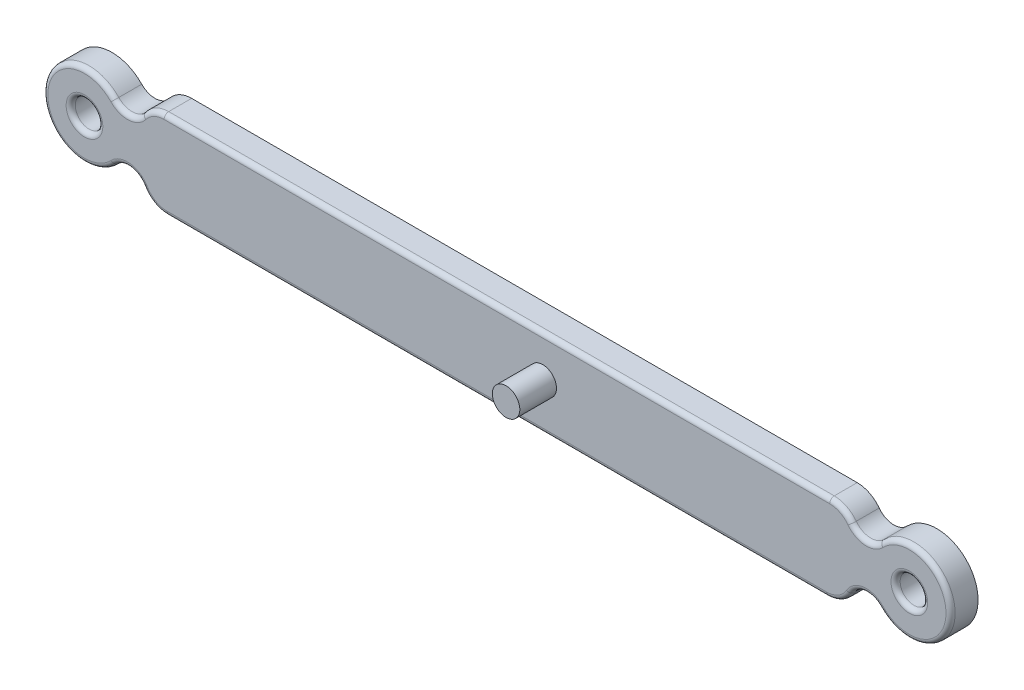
from build123d import *

# Parameters (mm, degrees)
ESQUISSE1_R      = 15
EXTRUSION1_DEPTH = 30
CONG_1_R         = 5
ESQUISSE2_R      = 15
EXTRUSION2_DEPTH = 40
CHANFREIN1_SIZE  = 1


with BuildPart() as part:
    # Esquisse1 → Extrusion1 (new body)
    with BuildSketch(Plane.XY):
        with BuildLine():
            Line((86.904157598, 45), (813.095842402, 45))
            ThreePointArc((813.095842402, 45), (826.512250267, 41.83281573), (837.095842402, 33))
            ThreePointArc((837.095842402, 33), (851.884773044, 25.036700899), (867.527890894, 31.153846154))
            ThreePointArc((867.527890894, 31.153846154), (945, 0), (867.527890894, -31.153846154))
            ThreePointArc((867.527890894, -31.153846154), (850.690842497, -25.145127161), (835.775334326, -35))
            ThreePointArc((835.775334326, -35), (824.794572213, -45.980762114), (809.794572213, -50))
            Line((809.794572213, -50), (90.205427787, -50))
            ThreePointArc((90.205427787, -50), (75.205427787, -45.980762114), (64.224665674, -35))
            ThreePointArc((64.224665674, -35), (49.309157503, -25.145127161), (32.472109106, -31.153846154))
            ThreePointArc((32.472109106, -31.153846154), (-45, 0), (32.472109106, 31.153846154))
            ThreePointArc((32.472109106, 31.153846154), (48.115226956, 25.036700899), (62.904157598, 33))
            ThreePointArc((62.904157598, 33), (73.487749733, 41.83281573), (86.904157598, 45))
        make_face()
        Circle(ESQUISSE1_R, mode=Mode.SUBTRACT)
        with Locations((900, 0)):
            Circle(ESQUISSE1_R, mode=Mode.SUBTRACT)
    extrude(amount=EXTRUSION1_DEPTH)

    # Cong_1
    cong_1_edges = [part.edges().sort_by_distance(p)[0] for p in [
        (-45, 0, 30),
        (49.309157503, -25.145127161, 30),
        (75.205427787, -45.980762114, 30),
        (450, -50, 30),
        (824.794572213, -45.980762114, 30),
        (850.690842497, -25.145127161, 30),
        (945, 0, 30),
        (-15, 0, 30),
        (851.884773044, 25.036700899, 30),
        (885, 0, 30),
        (826.512250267, 41.83281573, 30),
        (450, 45, 30),
        (73.487749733, 41.83281573, 30),
        (48.115226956, 25.036700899, 30),
    ]]
    fillet(cong_1_edges, radius=CONG_1_R)

    # Esquisse2 → Extrusion2 (add, symmetric)
    with BuildSketch(Plane.XY.offset(30)):
        with Locations((500, 0)):
            Circle(ESQUISSE2_R)
    extrude(amount=EXTRUSION2_DEPTH, both=True)

    # Chanfrein1
    chanfrein1_edges = [part.edges().sort_by_distance(p)[0] for p in [
        (485, 0, -10),
    ]]
    chamfer(chanfrein1_edges, length=CHANFREIN1_SIZE)


solid = part.part
